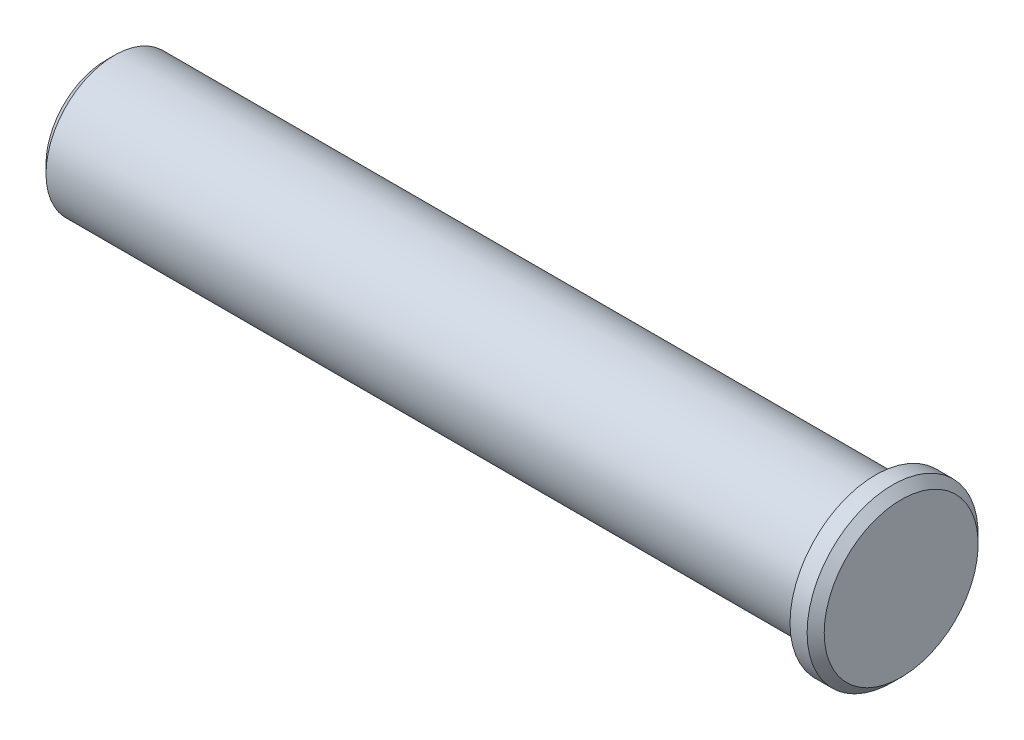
from build123d import *

# Parameters (mm, degrees)
ESQUISSE2_R             = 1.2
ENL_V_MAT_EXTRU_1_DEPTH = 64.529444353


with BuildPart() as part:
    # Esquisse1 → R_volution1 (revolve)
    with BuildSketch(Plane.XY, mode=Mode.PRIVATE) as r_volution1_sk:
        Polygon((-30.06462804, 8), (58.93537196, 8), (58.93537196, 10), (60.93537196, 10), (61.93537196, 9), (61.93537196, 0), (-31.06462804, 0), (-31.06462804, 7), align=None)
    revolve(r_volution1_sk.sketch.rotate(Axis((-36.779071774, 0, 0), (1, 0, 0)), 90), axis=Axis((-36.779071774, 0, 0), (1, 0, 0)))

    # Esquisse2 → Enl_v. mat.-Extru.1 (cut, through all)
    with BuildSketch(Plane.XY):
        with Locations((-28.104715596, 0)):
            Circle(ESQUISSE2_R)
    extrude(amount=-ENL_V_MAT_EXTRU_1_DEPTH, mode=Mode.SUBTRACT)


solid = part.part
